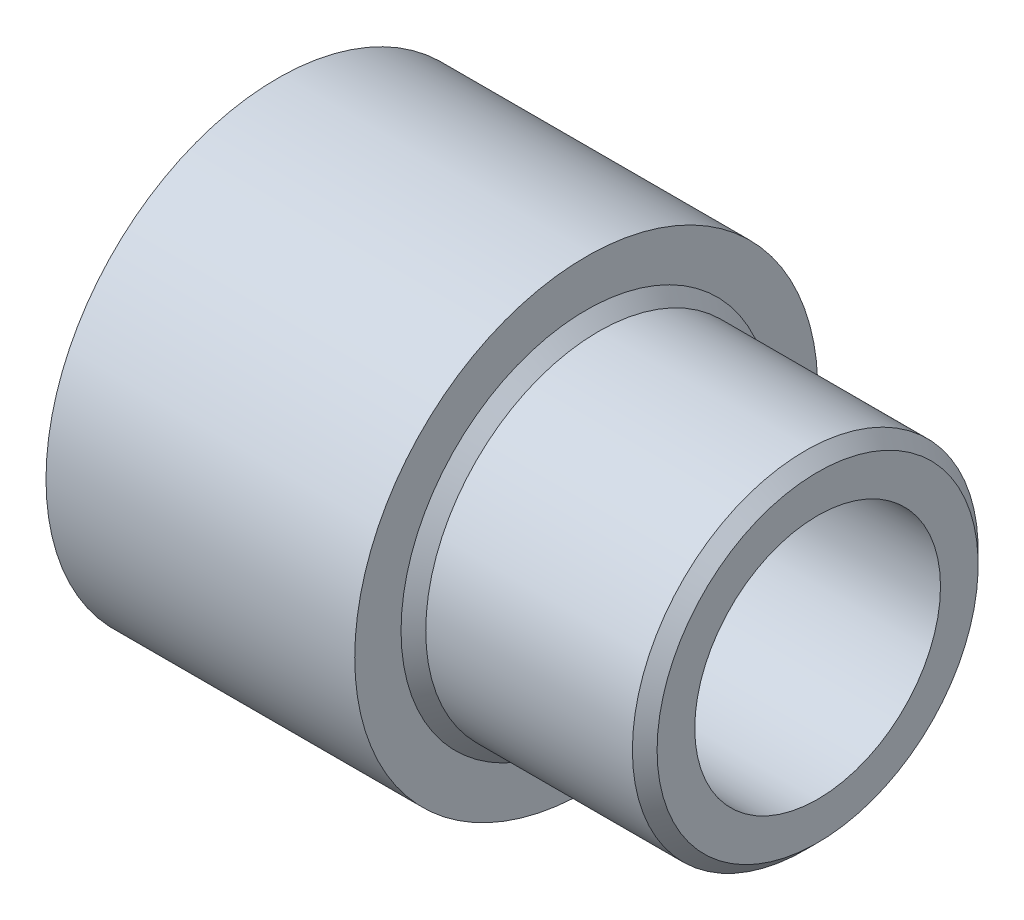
ISO-10303-21;
HEADER;
FILE_DESCRIPTION(('STEP AP214'),'2;1');
FILE_NAME('part.step','',(''),(''),'','','');
FILE_SCHEMA(('AUTOMOTIVE_DESIGN { 1 0 10303 214 1 1 1 1 }'));
ENDSEC;
DATA;
#1=APPLICATION_CONTEXT('core data for automotive mechanical design processes');
#2=APPLICATION_PROTOCOL_DEFINITION('international standard','automotive_design',2000,#1);
#3=PRODUCT_CONTEXT('',#1,'mechanical');
#4=PRODUCT('Part','Part','',(#3));
#5=PRODUCT_RELATED_PRODUCT_CATEGORY('part','',(#4));
#6=PRODUCT_DEFINITION_FORMATION('','',#4);
#7=PRODUCT_DEFINITION_CONTEXT('part definition',#1,'design');
#8=PRODUCT_DEFINITION('design','',#6,#7);
#9=PRODUCT_DEFINITION_SHAPE('','',#8);
#10=(LENGTH_UNIT() NAMED_UNIT(*) SI_UNIT(.MILLI.,.METRE.));
#11=(NAMED_UNIT(*) PLANE_ANGLE_UNIT() SI_UNIT($,.RADIAN.));
#12=(NAMED_UNIT(*) SI_UNIT($,.STERADIAN.) SOLID_ANGLE_UNIT());
#13=UNCERTAINTY_MEASURE_WITH_UNIT(LENGTH_MEASURE(1.E-05),#10,'distance_accuracy_value','');
#14=(GEOMETRIC_REPRESENTATION_CONTEXT(3) GLOBAL_UNCERTAINTY_ASSIGNED_CONTEXT((#13)) GLOBAL_UNIT_ASSIGNED_CONTEXT((#10,
#11,#12)) REPRESENTATION_CONTEXT('',''));
#15=CARTESIAN_POINT('',(0.,0.,0.));
#16=DIRECTION('',(0.,0.,1.));
#17=DIRECTION('',(1.,0.,0.));
#18=AXIS2_PLACEMENT_3D('',#15,#16,#17);
#19=CARTESIAN_POINT('',(33.3248,0.,0.));
#20=DIRECTION('',(-1.,0.,0.));
#21=DIRECTION('',(0.,0.,1.));
#22=AXIS2_PLACEMENT_3D('',#19,#20,#21);
#23=PLANE('',#22);
#24=CARTESIAN_POINT('',(33.3248,0.,0.));
#25=DIRECTION('',(-1.,0.,0.));
#26=DIRECTION('',(0.,0.,1.));
#27=AXIS2_PLACEMENT_3D('',#24,#25,#26);
#28=CIRCLE('',#27,9.90599999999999);
#29=CARTESIAN_POINT('',(33.3248,0.,9.90599999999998));
#30=VERTEX_POINT('',#29);
#31=EDGE_CURVE('E10',#30,#30,#28,.F.);
#32=ORIENTED_EDGE('',*,*,#31,.T.);
#33=EDGE_LOOP('',(#32));
#34=FACE_BOUND('',#33,.T.);
#35=CARTESIAN_POINT('',(33.3248,0.,0.));
#36=DIRECTION('',(1.,0.,0.));
#37=DIRECTION('',(0.,0.,-1.));
#38=AXIS2_PLACEMENT_3D('',#35,#36,#37);
#39=CIRCLE('',#38,7.5819);
#40=CARTESIAN_POINT('',(33.3248,0.,-7.5819));
#41=VERTEX_POINT('',#40);
#42=EDGE_CURVE('E62',#41,#41,#39,.T.);
#43=ORIENTED_EDGE('',*,*,#42,.F.);
#44=EDGE_LOOP('',(#43));
#45=FACE_BOUND('',#44,.T.);
#46=ADVANCED_FACE('F32',(#34,#45),#23,.F.);
#47=CARTESIAN_POINT('',(15.875,0.,0.));
#48=DIRECTION('',(-1.,0.,0.));
#49=DIRECTION('',(0.,0.,1.));
#50=AXIS2_PLACEMENT_3D('',#47,#48,#49);
#51=PLANE('',#50);
#52=CARTESIAN_POINT('',(15.875,0.,0.));
#53=DIRECTION('',(-1.,0.,0.));
#54=DIRECTION('',(0.,0.,1.));
#55=AXIS2_PLACEMENT_3D('',#52,#53,#54);
#56=CIRCLE('',#55,10.8204);
#57=CARTESIAN_POINT('',(15.875,0.,10.8204));
#58=VERTEX_POINT('',#57);
#59=EDGE_CURVE('E56',#58,#58,#56,.T.);
#60=ORIENTED_EDGE('',*,*,#59,.T.);
#61=EDGE_LOOP('',(#60));
#62=FACE_BOUND('',#61,.T.);
#63=CARTESIAN_POINT('',(15.875,0.,0.));
#64=DIRECTION('',(1.,0.,0.));
#65=DIRECTION('',(0.,0.,-1.));
#66=AXIS2_PLACEMENT_3D('',#63,#64,#65);
#67=CIRCLE('',#66,7.5819);
#68=CARTESIAN_POINT('',(15.875,0.,-7.5819));
#69=VERTEX_POINT('',#68);
#70=EDGE_CURVE('E65',#69,#69,#67,.T.);
#71=ORIENTED_EDGE('',*,*,#70,.T.);
#72=EDGE_LOOP('',(#71));
#73=FACE_BOUND('',#72,.T.);
#74=ADVANCED_FACE('F75',(#62,#73),#51,.T.);
#75=CARTESIAN_POINT('',(19.05,0.,0.));
#76=DIRECTION('',(-1.,0.,0.));
#77=DIRECTION('',(0.,0.,1.));
#78=AXIS2_PLACEMENT_3D('',#75,#76,#77);
#79=CYLINDRICAL_SURFACE('',#78,14.2875);
#80=CARTESIAN_POINT('',(19.05,0.,0.));
#81=DIRECTION('',(1.,0.,0.));
#82=DIRECTION('',(0.,0.,-1.));
#83=AXIS2_PLACEMENT_3D('',#80,#81,#82);
#84=CIRCLE('',#83,14.2875);
#85=CARTESIAN_POINT('',(19.05,0.,14.2875));
#86=VERTEX_POINT('',#85);
#87=EDGE_CURVE('E52',#86,#86,#84,.T.);
#88=CARTESIAN_POINT('',(0.,0.,0.));
#89=DIRECTION('',(1.,0.,0.));
#90=DIRECTION('',(0.,0.,-1.));
#91=AXIS2_PLACEMENT_3D('',#88,#89,#90);
#92=CIRCLE('',#91,14.2875);
#93=CARTESIAN_POINT('',(0.,0.,14.2875));
#94=VERTEX_POINT('',#93);
#95=EDGE_CURVE('E53',#94,#94,#92,.T.);
#96=CARTESIAN_POINT('',(19.05,0.,14.2875));
#97=CARTESIAN_POINT('',(18.8515625,0.,14.2875));
#98=CARTESIAN_POINT('',(18.653125,0.,14.2875));
#99=CARTESIAN_POINT('',(18.25625,0.,14.2875));
#100=CARTESIAN_POINT('',(18.0578125,0.,14.2875));
#101=CARTESIAN_POINT('',(17.6609375,0.,14.2875));
#102=CARTESIAN_POINT('',(17.4625,0.,14.2875));
#103=CARTESIAN_POINT('',(17.065625,0.,14.2875));
#104=CARTESIAN_POINT('',(16.8671875,0.,14.2875));
#105=CARTESIAN_POINT('',(16.4703125,0.,14.2875));
#106=CARTESIAN_POINT('',(16.271875,0.,14.2875));
#107=CARTESIAN_POINT('',(15.875,0.,14.2875));
#108=CARTESIAN_POINT('',(15.6765625,0.,14.2875));
#109=CARTESIAN_POINT('',(15.2796875,0.,14.2875));
#110=CARTESIAN_POINT('',(15.08125,0.,14.2875));
#111=CARTESIAN_POINT('',(14.684375,0.,14.2875));
#112=CARTESIAN_POINT('',(14.4859375,0.,14.2875));
#113=CARTESIAN_POINT('',(14.0890625,0.,14.2875));
#114=CARTESIAN_POINT('',(13.890625,0.,14.2875));
#115=CARTESIAN_POINT('',(13.49375,0.,14.2875));
#116=CARTESIAN_POINT('',(13.2953125,0.,14.2875));
#117=CARTESIAN_POINT('',(12.8984375,0.,14.2875));
#118=CARTESIAN_POINT('',(12.7,0.,14.2875));
#119=CARTESIAN_POINT('',(12.303125,0.,14.2875));
#120=CARTESIAN_POINT('',(12.1046875,0.,14.2875));
#121=CARTESIAN_POINT('',(11.7078125,0.,14.2875));
#122=CARTESIAN_POINT('',(11.509375,0.,14.2875));
#123=CARTESIAN_POINT('',(11.1125,0.,14.2875));
#124=CARTESIAN_POINT('',(10.9140625,0.,14.2875));
#125=CARTESIAN_POINT('',(10.5171875,0.,14.2875));
#126=CARTESIAN_POINT('',(10.31875,0.,14.2875));
#127=CARTESIAN_POINT('',(9.921875,0.,14.2875));
#128=CARTESIAN_POINT('',(9.7234375,0.,14.2875));
#129=CARTESIAN_POINT('',(9.3265625,0.,14.2875));
#130=CARTESIAN_POINT('',(9.128125,0.,14.2875));
#131=CARTESIAN_POINT('',(8.73125,0.,14.2875));
#132=CARTESIAN_POINT('',(8.5328125,0.,14.2875));
#133=CARTESIAN_POINT('',(8.1359375,0.,14.2875));
#134=CARTESIAN_POINT('',(7.9375,0.,14.2875));
#135=CARTESIAN_POINT('',(7.540625,0.,14.2875));
#136=CARTESIAN_POINT('',(7.3421875,0.,14.2875));
#137=CARTESIAN_POINT('',(6.9453125,0.,14.2875));
#138=CARTESIAN_POINT('',(6.746875,0.,14.2875));
#139=CARTESIAN_POINT('',(6.35,0.,14.2875));
#140=CARTESIAN_POINT('',(6.1515625,0.,14.2875));
#141=CARTESIAN_POINT('',(5.7546875,0.,14.2875));
#142=CARTESIAN_POINT('',(5.55625,0.,14.2875));
#143=CARTESIAN_POINT('',(5.159375,0.,14.2875));
#144=CARTESIAN_POINT('',(4.9609375,0.,14.2875));
#145=CARTESIAN_POINT('',(4.5640625,0.,14.2875));
#146=CARTESIAN_POINT('',(4.365625,0.,14.2875));
#147=CARTESIAN_POINT('',(3.96875,0.,14.2875));
#148=CARTESIAN_POINT('',(3.7703125,0.,14.2875));
#149=CARTESIAN_POINT('',(3.3734375,0.,14.2875));
#150=CARTESIAN_POINT('',(3.175,0.,14.2875));
#151=CARTESIAN_POINT('',(2.778125,0.,14.2875));
#152=CARTESIAN_POINT('',(2.5796875,0.,14.2875));
#153=CARTESIAN_POINT('',(2.1828125,0.,14.2875));
#154=CARTESIAN_POINT('',(1.984375,0.,14.2875));
#155=CARTESIAN_POINT('',(1.5875,0.,14.2875));
#156=CARTESIAN_POINT('',(1.3890625,0.,14.2875));
#157=CARTESIAN_POINT('',(0.992187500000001,0.,14.2875));
#158=CARTESIAN_POINT('',(0.793750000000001,0.,14.2875));
#159=CARTESIAN_POINT('',(0.396875,0.,14.2875));
#160=CARTESIAN_POINT('',(0.1984375,0.,14.2875));
#161=CARTESIAN_POINT('',(0.,0.,14.2875));
#162=B_SPLINE_CURVE_WITH_KNOTS('',3,(#96,#97,#98,#99,#100,#101,#102,#103,#104,#105,#106,#107,
#108,#109,#110,#111,#112,#113,#114,#115,#116,#117,#118,#119,#120,#121,#122,#123,#124,#125,#126,
#127,#128,#129,#130,#131,#132,#133,#134,#135,#136,#137,#138,#139,#140,#141,#142,#143,#144,#145,
#146,#147,#148,#149,#150,#151,#152,#153,#154,#155,#156,#157,#158,#159,#160,#161),.UNSPECIFIED.,
.F.,.F.,(4,2,2,2,2,2,2,2,2,2,2,2,2,2,2,2,2,2,2,2,2,2,2,2,2,2,2,2,2,2,2,2,4),(0.,0.5953125,
1.190625,1.7859375,2.38125,2.9765625,3.571875,4.1671875,4.7625,5.3578125,5.953125,6.5484375,
7.14375,7.7390625,8.334375,8.9296875,9.525,10.1203125,10.715625,11.3109375,11.90625,12.5015625,
13.096875,13.6921875,14.2875,14.8828125,15.478125,16.0734375,16.66875,17.2640625,17.859375,
18.4546875,19.05),.UNSPECIFIED.);
#163=EDGE_CURVE('BSEAM80',#86,#94,#162,.T.);
#164=ORIENTED_EDGE('',*,*,#87,.F.);
#165=ORIENTED_EDGE('',*,*,#95,.T.);
#166=ORIENTED_EDGE('',*,*,#163,.T.);
#167=ORIENTED_EDGE('',*,*,#163,.F.);
#168=EDGE_LOOP('',(#164,#166,#165,#167));
#169=FACE_BOUND('',#168,.T.);
#170=ADVANCED_FACE('F80',(#169),#79,.T.);
#171=CARTESIAN_POINT('',(19.05,0.,0.));
#172=DIRECTION('',(1.,0.,0.));
#173=DIRECTION('',(0.,0.,-1.));
#174=AXIS2_PLACEMENT_3D('',#171,#172,#173);
#175=PLANE('',#174);
#176=CARTESIAN_POINT('',(19.05,0.,0.));
#177=DIRECTION('',(1.,0.,0.));
#178=DIRECTION('',(0.,0.,-1.));
#179=AXIS2_PLACEMENT_3D('',#176,#177,#178);
#180=CIRCLE('',#179,11.43);
#181=CARTESIAN_POINT('',(19.05,0.,-11.43));
#182=VERTEX_POINT('',#181);
#183=EDGE_CURVE('E39',#182,#182,#180,.F.);
#184=ORIENTED_EDGE('',*,*,#183,.T.);
#185=EDGE_LOOP('',(#184));
#186=FACE_BOUND('',#185,.T.);
#187=ORIENTED_EDGE('',*,*,#87,.T.);
#188=EDGE_LOOP('',(#187));
#189=FACE_BOUND('',#188,.T.);
#190=ADVANCED_FACE('F92',(#186,#189),#175,.T.);
#191=CARTESIAN_POINT('',(0.,0.,0.));
#192=DIRECTION('',(1.,0.,0.));
#193=DIRECTION('',(0.,0.,-1.));
#194=AXIS2_PLACEMENT_3D('',#191,#192,#193);
#195=PLANE('',#194);
#196=CARTESIAN_POINT('',(0.,0.,0.));
#197=DIRECTION('',(-1.,0.,0.));
#198=DIRECTION('',(0.,0.,1.));
#199=AXIS2_PLACEMENT_3D('',#196,#197,#198);
#200=CIRCLE('',#199,10.8204);
#201=CARTESIAN_POINT('',(0.,0.,10.8204));
#202=VERTEX_POINT('',#201);
#203=EDGE_CURVE('E59',#202,#202,#200,.T.);
#204=ORIENTED_EDGE('',*,*,#203,.F.);
#205=EDGE_LOOP('',(#204));
#206=FACE_BOUND('',#205,.T.);
#207=ORIENTED_EDGE('',*,*,#95,.F.);
#208=EDGE_LOOP('',(#207));
#209=FACE_BOUND('',#208,.T.);
#210=ADVANCED_FACE('F90',(#206,#209),#195,.F.);
#211=CARTESIAN_POINT('',(33.3248,0.,0.));
#212=DIRECTION('',(-1.,0.,0.));
#213=DIRECTION('',(0.,0.,1.));
#214=AXIS2_PLACEMENT_3D('',#211,#212,#213);
#215=CYLINDRICAL_SURFACE('',#214,10.668);
#216=CARTESIAN_POINT('',(19.812,0.,0.));
#217=DIRECTION('',(1.,0.,0.));
#218=DIRECTION('',(0.,0.,-1.));
#219=AXIS2_PLACEMENT_3D('',#216,#217,#218);
#220=CIRCLE('',#219,10.668);
#221=CARTESIAN_POINT('',(19.812,0.,-10.668));
#222=VERTEX_POINT('',#221);
#223=EDGE_CURVE('E43',#222,#222,#220,.T.);
#224=ORIENTED_EDGE('',*,*,#223,.T.);
#225=EDGE_LOOP('',(#224));
#226=FACE_BOUND('',#225,.T.);
#227=CARTESIAN_POINT('',(32.5628,0.,0.));
#228=DIRECTION('',(-1.,0.,0.));
#229=DIRECTION('',(0.,0.,1.));
#230=AXIS2_PLACEMENT_3D('',#227,#228,#229);
#231=CIRCLE('',#230,10.668);
#232=CARTESIAN_POINT('',(32.5628,0.,10.668));
#233=VERTEX_POINT('',#232);
#234=EDGE_CURVE('E47',#233,#233,#231,.T.);
#235=ORIENTED_EDGE('',*,*,#234,.T.);
#236=EDGE_LOOP('',(#235));
#237=FACE_BOUND('',#236,.T.);
#238=ADVANCED_FACE('F86',(#226,#237),#215,.T.);
#239=CARTESIAN_POINT('',(19.812,0.,0.));
#240=DIRECTION('',(-1.,0.,0.));
#241=DIRECTION('',(0.,0.,1.));
#242=AXIS2_PLACEMENT_3D('',#239,#240,#241);
#243=CONICAL_SURFACE('',#242,10.668,0.78539816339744);
#244=ORIENTED_EDGE('',*,*,#183,.F.);
#245=EDGE_LOOP('',(#244));
#246=FACE_BOUND('',#245,.T.);
#247=ORIENTED_EDGE('',*,*,#223,.F.);
#248=EDGE_LOOP('',(#247));
#249=FACE_BOUND('',#248,.T.);
#250=ADVANCED_FACE('F89',(#246,#249),#243,.T.);
#251=CARTESIAN_POINT('',(32.5628,0.,0.));
#252=DIRECTION('',(-1.,0.,0.));
#253=DIRECTION('',(0.,0.,1.));
#254=AXIS2_PLACEMENT_3D('',#251,#252,#253);
#255=CONICAL_SURFACE('',#254,10.668,0.785398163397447);
#256=CARTESIAN_POINT('',(33.3248,0.,9.90599999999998));
#257=CARTESIAN_POINT('',(33.3168625,0.,9.91393749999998));
#258=CARTESIAN_POINT('',(33.308925,0.,9.92187499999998));
#259=CARTESIAN_POINT('',(33.29305,0.,9.93774999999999));
#260=CARTESIAN_POINT('',(33.2851125,0.,9.94568749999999));
#261=CARTESIAN_POINT('',(33.2692375,0.,9.96156249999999));
#262=CARTESIAN_POINT('',(33.2613,0.,9.96949999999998));
#263=CARTESIAN_POINT('',(33.245425,0.,9.98537499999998));
#264=CARTESIAN_POINT('',(33.2374875,0.,9.99331249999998));
#265=CARTESIAN_POINT('',(33.2216125,0.,10.0091875));
#266=CARTESIAN_POINT('',(33.213675,0.,10.017125));
#267=CARTESIAN_POINT('',(33.1978,0.,10.033));
#268=CARTESIAN_POINT('',(33.1898625,0.,10.0409375));
#269=CARTESIAN_POINT('',(33.1739875,0.,10.0568125));
#270=CARTESIAN_POINT('',(33.16605,0.,10.06475));
#271=CARTESIAN_POINT('',(33.150175,0.,10.080625));
#272=CARTESIAN_POINT('',(33.1422375,0.,10.0885625));
#273=CARTESIAN_POINT('',(33.1263625,0.,10.1044375));
#274=CARTESIAN_POINT('',(33.118425,0.,10.112375));
#275=CARTESIAN_POINT('',(33.10255,0.,10.12825));
#276=CARTESIAN_POINT('',(33.0946125,0.,10.1361875));
#277=CARTESIAN_POINT('',(33.0787375,0.,10.1520625));
#278=CARTESIAN_POINT('',(33.0708,0.,10.16));
#279=CARTESIAN_POINT('',(33.054925,0.,10.175875));
#280=CARTESIAN_POINT('',(33.0469875,0.,10.1838125));
#281=CARTESIAN_POINT('',(33.0311125,0.,10.1996875));
#282=CARTESIAN_POINT('',(33.023175,0.,10.207625));
#283=CARTESIAN_POINT('',(33.0073,0.,10.2235));
#284=CARTESIAN_POINT('',(32.9993625,0.,10.2314375));
#285=CARTESIAN_POINT('',(32.9834875,0.,10.2473125));
#286=CARTESIAN_POINT('',(32.97555,0.,10.25525));
#287=CARTESIAN_POINT('',(32.959675,0.,10.271125));
#288=CARTESIAN_POINT('',(32.9517375,0.,10.2790625));
#289=CARTESIAN_POINT('',(32.9358625,0.,10.2949375));
#290=CARTESIAN_POINT('',(32.927925,0.,10.302875));
#291=CARTESIAN_POINT('',(32.91205,0.,10.31875));
#292=CARTESIAN_POINT('',(32.9041125,0.,10.3266875));
#293=CARTESIAN_POINT('',(32.8882375,0.,10.3425625));
#294=CARTESIAN_POINT('',(32.8803,0.,10.3505));
#295=CARTESIAN_POINT('',(32.864425,0.,10.366375));
#296=CARTESIAN_POINT('',(32.8564875,0.,10.3743125));
#297=CARTESIAN_POINT('',(32.8406125,0.,10.3901875));
#298=CARTESIAN_POINT('',(32.832675,0.,10.398125));
#299=CARTESIAN_POINT('',(32.8168,0.,10.414));
#300=CARTESIAN_POINT('',(32.8088625,0.,10.4219375));
#301=CARTESIAN_POINT('',(32.7929875,0.,10.4378125));
#302=CARTESIAN_POINT('',(32.78505,0.,10.44575));
#303=CARTESIAN_POINT('',(32.769175,0.,10.461625));
#304=CARTESIAN_POINT('',(32.7612375,0.,10.4695625));
#305=CARTESIAN_POINT('',(32.7453625,0.,10.4854375));
#306=CARTESIAN_POINT('',(32.737425,0.,10.493375));
#307=CARTESIAN_POINT('',(32.72155,0.,10.50925));
#308=CARTESIAN_POINT('',(32.7136125,0.,10.5171875));
#309=CARTESIAN_POINT('',(32.6977375,0.,10.5330625));
#310=CARTESIAN_POINT('',(32.6898,0.,10.541));
#311=CARTESIAN_POINT('',(32.673925,0.,10.556875));
#312=CARTESIAN_POINT('',(32.6659875,0.,10.5648125));
#313=CARTESIAN_POINT('',(32.6501125,0.,10.5806875));
#314=CARTESIAN_POINT('',(32.642175,0.,10.588625));
#315=CARTESIAN_POINT('',(32.6263,0.,10.6045));
#316=CARTESIAN_POINT('',(32.6183625,0.,10.6124375));
#317=CARTESIAN_POINT('',(32.6024875,0.,10.6283125));
#318=CARTESIAN_POINT('',(32.59455,0.,10.63625));
#319=CARTESIAN_POINT('',(32.578675,0.,10.652125));
#320=CARTESIAN_POINT('',(32.5707375,0.,10.6600625));
#321=CARTESIAN_POINT('',(32.5628,0.,10.668));
#322=B_SPLINE_CURVE_WITH_KNOTS('',3,(#256,#257,#258,#259,#260,#261,#262,#263,#264,#265,#266,
#267,#268,#269,#270,#271,#272,#273,#274,#275,#276,#277,#278,#279,#280,#281,#282,#283,#284,#285,
#286,#287,#288,#289,#290,#291,#292,#293,#294,#295,#296,#297,#298,#299,#300,#301,#302,#303,#304,
#305,#306,#307,#308,#309,#310,#311,#312,#313,#314,#315,#316,#317,#318,#319,#320,#321),
.UNSPECIFIED.,.F.,.F.,(4,2,2,2,2,2,2,2,2,2,2,2,2,2,2,2,2,2,2,2,2,2,2,2,2,2,2,2,2,2,2,2,4),(0.,
0.0336759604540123,0.067351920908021,0.101027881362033,0.134703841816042,0.168379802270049,
0.202055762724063,0.23573172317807,0.269407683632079,0.303083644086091,0.3367596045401,
0.370435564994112,0.404111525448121,0.437787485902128,0.471463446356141,0.505139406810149,
0.538815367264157,0.57249132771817,0.606167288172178,0.639843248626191,0.673519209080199,
0.707195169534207,0.74087112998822,0.774547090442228,0.808223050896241,0.84189901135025,
0.875574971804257,0.90925093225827,0.942926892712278,0.976602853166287,1.0102788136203,
1.04395477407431,1.07763073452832),.UNSPECIFIED.);
#323=EDGE_CURVE('BSEAM34',#30,#233,#322,.T.);
#324=ORIENTED_EDGE('',*,*,#31,.F.);
#325=ORIENTED_EDGE('',*,*,#234,.F.);
#326=ORIENTED_EDGE('',*,*,#323,.T.);
#327=ORIENTED_EDGE('',*,*,#323,.F.);
#328=EDGE_LOOP('',(#324,#326,#325,#327));
#329=FACE_BOUND('',#328,.T.);
#330=ADVANCED_FACE('F34',(#329),#255,.T.);
#331=CARTESIAN_POINT('',(15.875,0.,0.));
#332=DIRECTION('',(-1.,0.,0.));
#333=DIRECTION('',(0.,0.,1.));
#334=AXIS2_PLACEMENT_3D('',#331,#332,#333);
#335=CYLINDRICAL_SURFACE('',#334,10.8204);
#336=ORIENTED_EDGE('',*,*,#59,.F.);
#337=EDGE_LOOP('',(#336));
#338=FACE_BOUND('',#337,.T.);
#339=ORIENTED_EDGE('',*,*,#203,.T.);
#340=EDGE_LOOP('',(#339));
#341=FACE_BOUND('',#340,.T.);
#342=ADVANCED_FACE('F85',(#338,#341),#335,.F.);
#343=CARTESIAN_POINT('',(33.3248,0.,0.));
#344=DIRECTION('',(-1.,0.,0.));
#345=DIRECTION('',(0.,0.,1.));
#346=AXIS2_PLACEMENT_3D('',#343,#344,#345);
#347=CYLINDRICAL_SURFACE('',#346,7.5819);
#348=ORIENTED_EDGE('',*,*,#42,.T.);
#349=EDGE_LOOP('',(#348));
#350=FACE_BOUND('',#349,.T.);
#351=ORIENTED_EDGE('',*,*,#70,.F.);
#352=EDGE_LOOP('',(#351));
#353=FACE_BOUND('',#352,.T.);
#354=ADVANCED_FACE('F71',(#350,#353),#347,.F.);
#355=CLOSED_SHELL('',(#46,#74,#170,#190,#210,#238,#250,#330,#342,#354));
#356=MANIFOLD_SOLID_BREP('B2',#355);
#357=ADVANCED_BREP_SHAPE_REPRESENTATION('',(#18,#356),#14);
#358=SHAPE_DEFINITION_REPRESENTATION(#9,#357);
ENDSEC;
END-ISO-10303-21;
